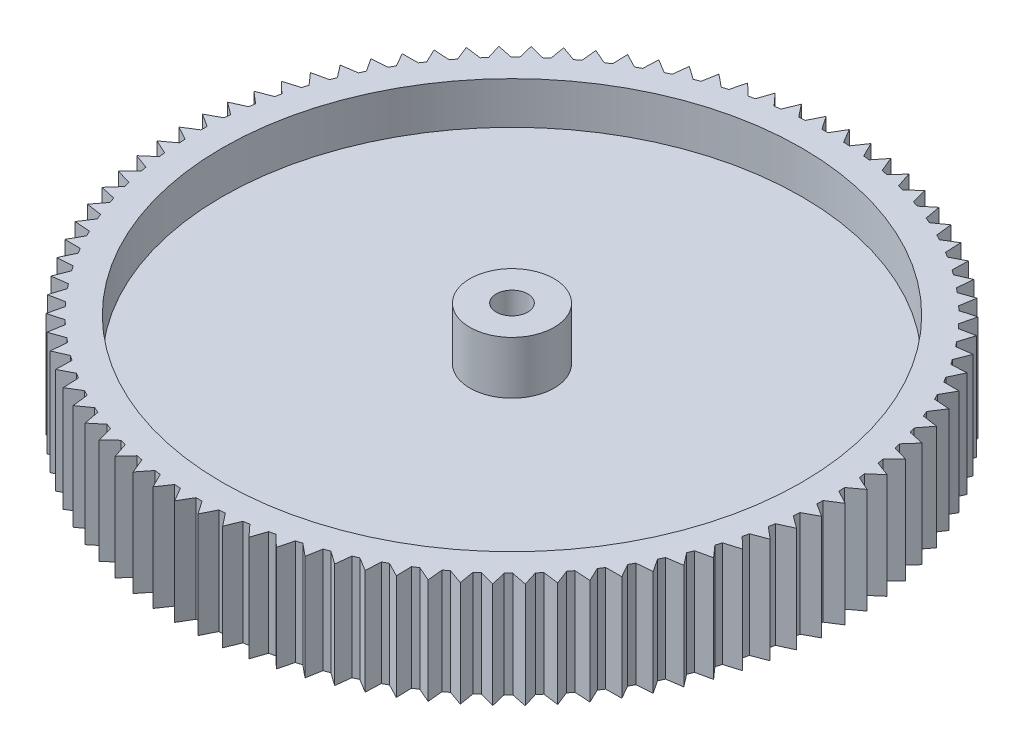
from build123d import *

# Parameters (mm, degrees)
BOSS_EXTRU_1_DEPTH            = 10
D_GAGEMENT_M481_D             = 55
D_GAGEMENT_M481_DEPTH         = 4
D_GAGEMENT_M482_D             = 55
D_GAGEMENT_M482_DEPTH         = 4
ESQUISSE6_W                   = 4
ESQUISSE6_H                   = 3
ESQUISSE7_W                   = 4
ESQUISSE7_H                   = 5
DIAM_TRE_DU_PER_AGE_3_0_3_1_D = 3


with BuildPart() as part:
    # Esquisse1 → Boss.-Extru.1 (new body)
    with BuildSketch(Plane(origin=(0, 10, 0), x_dir=(1, 0, 0), z_dir=(0, 1, 0))):
        with BuildLine():
            Line((1.519609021, 29.961488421), (0.746596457, 31.270360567))
            Line((0.746596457, 31.270360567), (0, 30))
            ThreePointArc((0, 30), (-0.287063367, 29.998626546), (-0.57410045, 29.994506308))
            Line((-0.57410045, 29.994506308), (-1.4365323, 31.246267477))
            Line((-1.4365323, 31.246267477), (-2.092694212, 29.926921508))
            ThreePointArc((-2.092694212, 29.926921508), (-2.3789625, 29.905526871), (-2.665012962, 29.881393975))
            Line((-2.665012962, 29.881393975), (-3.612662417, 31.069945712))
            Line((-3.612662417, 31.069945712), (-4.175193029, 29.708042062))
            ThreePointArc((-4.175193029, 29.708042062), (-4.459271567, 29.666730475), (-4.742941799, 29.622702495))
            Line((-4.742941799, 29.622702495), (-5.771192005, 30.742254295))
            Line((-5.771192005, 30.742254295), (-6.237350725, 29.344428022))
            ThreePointArc((-6.237350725, 29.344428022), (-6.517855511, 29.283400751), (-6.7977635, 29.219692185))
            Line((-6.7977635, 29.219692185), (-7.901604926, 30.264789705))
            Line((-7.901604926, 30.264789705), (-8.269120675, 28.837850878))
            ThreePointArc((-8.269120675, 28.837850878), (-8.544685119, 28.757405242), (-8.81946718, 28.674326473))
            Line((-8.81946718, 28.674326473), (-9.993522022, 29.639878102))
            Line((-9.993522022, 29.639878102), (-10.2606043, 28.190778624))
            ThreePointArc((-10.2606043, 28.190778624), (-10.529885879, 28.091306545), (-10.798203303, 27.989262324))
            Line((-10.798203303, 27.989262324), (-12.036751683, 28.870563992))
            Line((-12.036751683, 28.870563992), (-12.202099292, 27.406363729))
            ThreePointArc((-12.202099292, 27.406363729), (-12.463786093, 27.288349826), (-12.724331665, 27.167837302))
            Line((-12.724331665, 27.167837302), (-14.0213395, 27.960595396))
            Line((-14.0213395, 27.960595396), (-14.084146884, 26.488427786))
            ThreePointArc((-14.084146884, 26.488427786), (-14.336963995, 26.35244701), (-14.588468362, 26.214053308))
            Line((-14.588468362, 26.214053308), (-15.93761676, 26.91440559))
            Line((-15.93761676, 26.91440559), (-15.897577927, 25.441442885))
            ThreePointArc((-15.897577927, 25.441442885), (-16.140293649, 25.288157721), (-16.381531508, 25.132557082))
            Line((-16.381531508, 25.132557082), (-17.776247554, 25.737091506))
            Line((-17.776247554, 25.737091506), (-17.633557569, 24.270509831))
            ThreePointArc((-17.633557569, 24.270509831), (-17.864989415, 24.10066707), (-18.094785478, 23.928617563))
            Line((-18.094785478, 23.928617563), (-19.528274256, 24.434388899))
            Line((-19.528274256, 24.434388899), (-19.283628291, 22.981333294))
            ThreePointArc((-19.283628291, 22.981333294), (-19.502648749, 22.795760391), (-19.719883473, 22.608100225))
            Line((-19.719883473, 22.608100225), (-21.185161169, 23.012644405))
            Line((-21.185161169, 23.012644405), (-20.839751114, 21.58019401))
            ThreePointArc((-20.839751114, 21.58019401), (-21.045293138, 21.379795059), (-21.248908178, 21.177438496))
            Line((-21.248908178, 21.177438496), (-22.738836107, 21.478784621))
            Line((-22.738836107, 21.478784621), (-22.294344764, 20.073918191))
            ThreePointArc((-22.294344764, 20.073918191), (-22.485406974, 19.859669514), (-22.674410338, 19.643602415))
            Line((-22.674410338, 19.643602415), (-24.18172972, 19.840282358))
            Line((-24.18172972, 19.840282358), (-23.640322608, 18.46984426))
            ThreePointArc((-23.640322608, 18.46984426), (-23.815974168, 18.242789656), (-23.98944505, 18.014064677))
            Line((-23.98944505, 18.014064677), (-25.506812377, 18.105120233))
            Line((-25.506812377, 18.105120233), (-24.871127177, 16.775787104))
            ThreePointArc((-24.871127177, 16.775787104), (-25.030512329, 16.537032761), (-25.187605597, 16.296764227))
            Line((-25.187605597, 16.296764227), (-26.707628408, 16.281751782))
            Line((-26.707628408, 16.281751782), (-25.980762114, 15))
            ThreePointArc((-25.980762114, 15), (-26.123104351, 14.750709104), (-26.263054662, 14.50006758))
            Line((-26.263054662, 14.50006758), (-27.778327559, 14.379060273))
            Line((-27.778327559, 14.379060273), (-26.963821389, 13.151134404))
            ThreePointArc((-26.963821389, 13.151134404), (-27.088427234, 12.892521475), (-27.210552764, 12.632728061))
            Line((-27.210552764, 12.632728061), (-28.713693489, 12.406315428))
            Line((-28.713693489, 12.406315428), (-27.815515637, 11.238197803))
            ThreePointArc((-27.815515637, 11.238197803), (-27.921778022, 10.971522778), (-28.025483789, 10.703843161))
            Line((-28.025483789, 10.703843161), (-29.509169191, 10.373128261))
            Line((-29.509169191, 10.373128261), (-28.531695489, 9.270509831))
            ThreePointArc((-28.531695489, 9.270509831), (-28.619096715, 8.997071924), (-28.703877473, 8.722810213))
            Line((-28.703877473, 8.722810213), (-30.160879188, 8.289404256))
            Line((-30.160879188, 8.289404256), (-29.108871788, 7.257656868))
            ThreePointArc((-29.108871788, 7.257656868), (-29.176986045, 6.978788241), (-29.242428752, 6.69928061))
            Line((-29.242428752, 6.69928061), (-30.665648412, 6.165295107))
            Line((-30.665648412, 6.165295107), (-29.54423259, 5.20944533))
            ThreePointArc((-29.54423259, 5.20944533), (-29.592728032, 4.926504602), (-29.638513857, 4.643112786))
            Line((-29.638513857, 4.643112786), (-31.02101768, 4.011149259))
            Line((-31.02101768, 4.011149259), (-29.835656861, 3.135853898))
            ThreePointArc((-29.835656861, 3.135853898), (-29.864297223, 2.850219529), (-29.890203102, 2.564324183))
            Line((-29.890203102, 2.564324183), (-31.225255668, 1.837461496))
            Line((-31.225255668, 1.837461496), (-29.981724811, 1.046984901))
            ThreePointArc((-29.981724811, 1.046984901), (-29.99037056, 0.760048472), (-29.996270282, 0.47304245))
            Line((-29.996270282, 0.47304245), (-31.277367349, -0.345178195))
            Line((-31.277367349, -0.345178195), (-29.981724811, -1.046984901))
            ThreePointArc((-29.981724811, -1.046984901), (-29.970333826, -1.333825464), (-29.956198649, -1.620543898))
            Line((-29.956198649, -1.620543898), (-31.177098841, -2.526136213))
            Line((-31.177098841, -2.526136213), (-29.835656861, -3.135853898))
            ThreePointArc((-29.835656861, -3.135853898), (-29.804284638, -3.421201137), (-29.770183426, -3.706235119))
            Line((-29.770183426, -3.706235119), (-30.92493864, -4.694787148))
            Line((-30.92493864, -4.694787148), (-29.54423259, -5.20944533))
            ThreePointArc((-29.54423259, -5.20944533), (-29.493031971, -5.491909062), (-29.439130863, -5.773869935))
            Line((-29.439130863, -5.773869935), (-30.522115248, -6.840565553))
            Line((-30.522115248, -6.840565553), (-29.108871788, -7.257656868))
            ThreePointArc((-29.108871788, -7.257656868), (-29.038092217, -7.535860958), (-28.964653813, -7.813375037))
            Line((-28.964653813, -7.813375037), (-29.970591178, -8.95301741))
            Line((-29.970591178, -8.95301741), (-28.531695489, -9.270509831))
            ThreePointArc((-28.531695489, -9.270509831), (-28.441681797, -9.543098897), (-28.349063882, -9.814814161))
            Line((-28.349063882, -9.814814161), (-29.2730534, -11.021851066))
            Line((-29.2730534, -11.021851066), (-27.815515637, -11.238197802))
            ThreePointArc((-27.815515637, -11.238197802), (-27.706706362, -11.503843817), (-27.595360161, -11.768436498))
            Line((-27.595360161, -11.768436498), (-28.432900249, -13.036987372))
            Line((-28.432900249, -13.036987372), (-26.963821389, -13.151134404))
            ThreePointArc((-26.963821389, -13.151134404), (-26.836746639, -13.408543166), (-26.707214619, -13.664724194))
            Line((-26.707214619, -13.664724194), (-27.454224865, -14.988608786))
            Line((-27.454224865, -14.988608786), (-25.980762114, -15))
            ThreePointArc((-25.980762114, -15), (-25.836040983, -15.247917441), (-25.688954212, -15.494438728))
            Line((-25.688954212, -15.494438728), (-26.341795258, -16.867207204))
            Line((-26.341795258, -16.867207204), (-24.871127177, -16.775787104))
            ThreePointArc((-24.871127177, -16.775787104), (-24.709464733, -17.013005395), (-24.545539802, -17.248665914))
            Line((-24.545539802, -17.248665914), (-25.101031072, -18.663630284))
            Line((-25.101031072, -18.663630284), (-23.640322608, -18.46984426))
            ThreePointArc((-23.640322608, -18.46984426), (-23.462506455, -18.695207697), (-23.28254199, -18.918859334))
            Line((-23.28254199, -18.918859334), (-23.737977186, -20.369126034))
            Line((-23.737977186, -20.369126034), (-22.294344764, -20.073918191))
            ThreePointArc((-22.294344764, -20.073918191), (-22.101241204, -20.286328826), (-21.906113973, -20.496881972))
            Line((-21.906113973, -20.496881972), (-22.259274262, -21.975385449))
            Line((-22.259274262, -21.975385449), (-20.839751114, -21.58019401))
            ThreePointArc((-20.839751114, -21.58019401), (-20.632300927, -21.778617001), (-20.422961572, -21.975045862))
            Line((-20.422961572, -21.975045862), (-20.67212639, -23.474582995))
            Line((-20.67212639, -23.474582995), (-19.283628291, -22.981333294))
            ThreePointArc((-19.283628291, -22.981333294), (-19.062842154, -23.164801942), (-18.840310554, -23.346149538))
            Line((-18.840310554, -23.346149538), (-18.984265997, -24.859414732))
            Line((-18.984265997, -24.859414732), (-17.633557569, -24.270509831))
            ThreePointArc((-17.633557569, -24.270509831), (-17.40051113, -24.438130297), (-17.165871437, -24.603513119))
            Line((-17.165871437, -24.603513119), (-17.203916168, -26.1231339))
            Line((-17.203916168, -26.1231339), (-15.897577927, -25.441442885))
            ThreePointArc((-15.897577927, -25.441442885), (-15.653406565, -25.592398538), (-15.40780192, -25.741010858))
            Line((-15.40780192, -25.741010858), (-15.339750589, -27.259583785))
            Line((-15.339750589, -27.259583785), (-14.084146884, -26.488427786))
            ThreePointArc((-14.084146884, -26.488427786), (-13.830040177, -26.621983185), (-13.574667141, -26.753100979))
            Line((-13.574667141, -26.753100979), (-13.400851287, -28.263227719))
            Line((-13.400851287, -28.263227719), (-12.202099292, -27.406363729))
            ThreePointArc((-12.202099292, -27.406363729), (-11.939295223, -27.521868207), (-11.675397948, -27.634852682))
            Line((-11.675397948, -27.634852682), (-11.396664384, -29.129176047))
            Line((-11.396664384, -29.129176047), (-10.2606043, -28.190778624))
            ThreePointArc((-10.2606043, -28.190778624), (-9.990383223, -28.287669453), (-9.71924739, -28.38197016))
            Line((-9.71924739, -28.38197016), (-9.336954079, -29.853209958))
            Line((-9.336954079, -29.853209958), (-8.269120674, -28.837850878))
            ThreePointArc((-8.269120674, -28.837850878), (-7.99279908, -28.915656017), (-7.715745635, -28.990813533))
            Line((-7.715745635, -28.990813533), (-7.231755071, -30.431802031))
            Line((-7.231755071, -30.431802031), (-6.237350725, -29.344428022))
            ThreePointArc((-6.237350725, -29.344428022), (-5.956274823, -29.402768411), (-5.674653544, -29.458416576))
            Line((-5.674653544, -29.458416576), (-5.09132368, -30.862133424))
            Line((-5.09132368, -30.862133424), (-4.175193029, -29.708042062))
            ThreePointArc((-4.175193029, -29.708042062), (-3.890732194, -29.746633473), (-3.605915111, -29.782501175))
            Line((-3.605915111, -29.782501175), (-2.926087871, -31.142107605))
            Line((-2.926087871, -31.142107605), (-2.092694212, -29.926921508))
            ThreePointArc((-2.092694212, -29.926921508), (-1.80623431, -29.945575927), (-1.519609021, -29.961488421))
            Line((-1.519609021, -29.961488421), (-0.746596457, -31.270360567))
            Line((-0.746596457, -31.270360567), (0, -30))
            ThreePointArc((0, -30), (0.287063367, -29.998626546), (0.57410045, -29.994506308))
            Line((0.57410045, -29.994506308), (1.4365323, -31.246267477))
            Line((1.4365323, -31.246267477), (2.092694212, -29.926921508))
            ThreePointArc((2.092694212, -29.926921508), (2.3789625, -29.905526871), (2.665012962, -29.881393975))
            Line((2.665012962, -29.881393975), (3.612662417, -31.069945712))
            Line((3.612662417, -31.069945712), (4.175193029, -29.708042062))
            ThreePointArc((4.175193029, -29.708042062), (4.459271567, -29.666730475), (4.742941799, -29.622702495))
            Line((4.742941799, -29.622702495), (5.771192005, -30.742254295))
            Line((5.771192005, -30.742254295), (6.237350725, -29.344428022))
            ThreePointArc((6.237350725, -29.344428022), (6.517855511, -29.283400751), (6.7977635, -29.219692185))
            Line((6.7977635, -29.219692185), (7.901604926, -30.264789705))
            Line((7.901604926, -30.264789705), (8.269120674, -28.837850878))
            ThreePointArc((8.269120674, -28.837850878), (8.544685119, -28.757405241), (8.81946718, -28.674326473))
            Line((8.81946718, -28.674326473), (9.993522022, -29.639878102))
            Line((9.993522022, -29.639878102), (10.2606043, -28.190778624))
            ThreePointArc((10.2606043, -28.190778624), (10.529885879, -28.091306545), (10.798203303, -27.989262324))
            Line((10.798203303, -27.989262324), (12.036751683, -28.870563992))
            Line((12.036751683, -28.870563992), (12.202099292, -27.406363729))
            ThreePointArc((12.202099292, -27.406363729), (12.463786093, -27.288349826), (12.724331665, -27.167837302))
            Line((12.724331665, -27.167837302), (14.0213395, -27.960595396))
            Line((14.0213395, -27.960595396), (14.084146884, -26.488427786))
            ThreePointArc((14.084146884, -26.488427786), (14.336963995, -26.35244701), (14.588468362, -26.214053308))
            Line((14.588468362, -26.214053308), (15.93761676, -26.91440559))
            Line((15.93761676, -26.91440559), (15.897577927, -25.441442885))
            ThreePointArc((15.897577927, -25.441442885), (16.140293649, -25.288157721), (16.381531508, -25.132557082))
            Line((16.381531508, -25.132557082), (17.776247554, -25.737091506))
            Line((17.776247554, -25.737091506), (17.633557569, -24.270509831))
            ThreePointArc((17.633557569, -24.270509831), (17.864989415, -24.100667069), (18.094785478, -23.928617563))
            Line((18.094785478, -23.928617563), (19.528274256, -24.434388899))
            Line((19.528274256, -24.434388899), (19.283628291, -22.981333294))
            ThreePointArc((19.283628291, -22.981333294), (19.502648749, -22.795760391), (19.719883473, -22.608100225))
            Line((19.719883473, -22.608100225), (21.185161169, -23.012644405))
            Line((21.185161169, -23.012644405), (20.839751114, -21.58019401))
            ThreePointArc((20.839751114, -21.58019401), (21.045293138, -21.379795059), (21.248908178, -21.177438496))
            Line((21.248908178, -21.177438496), (22.738836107, -21.478784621))
            Line((22.738836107, -21.478784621), (22.294344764, -20.073918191))
            ThreePointArc((22.294344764, -20.073918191), (22.485406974, -19.859669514), (22.674410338, -19.643602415))
            Line((22.674410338, -19.643602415), (24.18172972, -19.840282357))
            Line((24.18172972, -19.840282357), (23.640322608, -18.46984426))
            ThreePointArc((23.640322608, -18.46984426), (23.815974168, -18.242789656), (23.98944505, -18.014064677))
            Line((23.98944505, -18.014064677), (25.506812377, -18.105120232))
            Line((25.506812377, -18.105120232), (24.871127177, -16.775787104))
            ThreePointArc((24.871127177, -16.775787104), (25.030512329, -16.537032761), (25.187605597, -16.296764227))
            Line((25.187605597, -16.296764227), (26.707628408, -16.281751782))
            Line((26.707628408, -16.281751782), (25.980762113, -15))
            ThreePointArc((25.980762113, -15), (26.123104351, -14.750709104), (26.263054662, -14.50006758))
            Line((26.263054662, -14.50006758), (27.778327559, -14.379060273))
            Line((27.778327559, -14.379060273), (26.963821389, -13.151134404))
            ThreePointArc((26.963821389, -13.151134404), (27.088427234, -12.892521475), (27.210552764, -12.632728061))
            Line((27.210552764, -12.632728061), (28.713693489, -12.406315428))
            Line((28.713693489, -12.406315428), (27.815515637, -11.238197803))
            ThreePointArc((27.815515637, -11.238197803), (27.921778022, -10.971522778), (28.025483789, -10.703843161))
            Line((28.025483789, -10.703843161), (29.509169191, -10.373128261))
            Line((29.509169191, -10.373128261), (28.531695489, -9.270509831))
            ThreePointArc((28.531695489, -9.270509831), (28.619096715, -8.997071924), (28.703877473, -8.722810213))
            Line((28.703877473, -8.722810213), (30.160879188, -8.289404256))
            Line((30.160879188, -8.289404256), (29.108871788, -7.257656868))
            ThreePointArc((29.108871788, -7.257656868), (29.176986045, -6.978788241), (29.242428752, -6.69928061))
            Line((29.242428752, -6.69928061), (30.665648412, -6.165295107))
            Line((30.665648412, -6.165295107), (29.54423259, -5.20944533))
            ThreePointArc((29.54423259, -5.20944533), (29.592728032, -4.926504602), (29.638513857, -4.643112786))
            Line((29.638513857, -4.643112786), (31.02101768, -4.011149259))
            Line((31.02101768, -4.011149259), (29.835656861, -3.135853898))
            ThreePointArc((29.835656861, -3.135853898), (29.864297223, -2.850219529), (29.890203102, -2.564324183))
            Line((29.890203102, -2.564324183), (31.225255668, -1.837461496))
            Line((31.225255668, -1.837461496), (29.981724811, -1.046984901))
            ThreePointArc((29.981724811, -1.046984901), (29.99037056, -0.760048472), (29.996270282, -0.47304245))
            Line((29.996270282, -0.47304245), (31.277367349, 0.345178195))
            Line((31.277367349, 0.345178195), (29.981724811, 1.046984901))
            ThreePointArc((29.981724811, 1.046984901), (29.970333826, 1.333825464), (29.956198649, 1.620543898))
            Line((29.956198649, 1.620543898), (31.177098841, 2.526136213))
            Line((31.177098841, 2.526136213), (29.835656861, 3.135853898))
            ThreePointArc((29.835656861, 3.135853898), (29.804284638, 3.421201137), (29.770183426, 3.706235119))
            Line((29.770183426, 3.706235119), (30.92493864, 4.694787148))
            Line((30.92493864, 4.694787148), (29.54423259, 5.20944533))
            ThreePointArc((29.54423259, 5.20944533), (29.493031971, 5.491909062), (29.439130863, 5.773869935))
            Line((29.439130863, 5.773869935), (30.522115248, 6.840565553))
            Line((30.522115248, 6.840565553), (29.108871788, 7.257656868))
            ThreePointArc((29.108871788, 7.257656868), (29.038092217, 7.535860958), (28.964653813, 7.813375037))
            Line((28.964653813, 7.813375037), (29.970591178, 8.95301741))
            Line((29.970591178, 8.95301741), (28.531695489, 9.270509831))
            ThreePointArc((28.531695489, 9.270509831), (28.441681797, 9.543098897), (28.349063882, 9.814814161))
            Line((28.349063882, 9.814814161), (29.2730534, 11.021851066))
            Line((29.2730534, 11.021851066), (27.815515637, 11.238197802))
            ThreePointArc((27.815515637, 11.238197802), (27.706706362, 11.503843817), (27.595360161, 11.768436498))
            Line((27.595360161, 11.768436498), (28.432900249, 13.036987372))
            Line((28.432900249, 13.036987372), (26.963821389, 13.151134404))
            ThreePointArc((26.963821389, 13.151134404), (26.836746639, 13.408543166), (26.707214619, 13.664724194))
            Line((26.707214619, 13.664724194), (27.454224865, 14.988608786))
            Line((27.454224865, 14.988608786), (25.980762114, 15))
            ThreePointArc((25.980762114, 15), (25.836040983, 15.247917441), (25.688954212, 15.494438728))
            Line((25.688954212, 15.494438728), (26.341795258, 16.867207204))
            Line((26.341795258, 16.867207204), (24.871127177, 16.775787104))
            ThreePointArc((24.871127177, 16.775787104), (24.709464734, 17.013005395), (24.545539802, 17.248665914))
            Line((24.545539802, 17.248665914), (25.101031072, 18.663630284))
            Line((25.101031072, 18.663630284), (23.640322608, 18.46984426))
            ThreePointArc((23.640322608, 18.46984426), (23.462506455, 18.695207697), (23.28254199, 18.918859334))
            Line((23.28254199, 18.918859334), (23.737977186, 20.369126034))
            Line((23.737977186, 20.369126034), (22.294344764, 20.073918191))
            ThreePointArc((22.294344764, 20.073918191), (22.101241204, 20.286328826), (21.906113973, 20.496881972))
            Line((21.906113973, 20.496881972), (22.259274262, 21.975385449))
            Line((22.259274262, 21.975385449), (20.839751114, 21.58019401))
            ThreePointArc((20.839751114, 21.58019401), (20.632300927, 21.778617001), (20.422961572, 21.975045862))
            Line((20.422961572, 21.975045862), (20.67212639, 23.474582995))
            Line((20.67212639, 23.474582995), (19.283628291, 22.981333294))
            ThreePointArc((19.283628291, 22.981333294), (19.062842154, 23.164801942), (18.840310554, 23.346149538))
            Line((18.840310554, 23.346149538), (18.984265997, 24.859414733))
            Line((18.984265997, 24.859414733), (17.633557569, 24.270509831))
            ThreePointArc((17.633557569, 24.270509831), (17.40051113, 24.438130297), (17.165871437, 24.603513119))
            Line((17.165871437, 24.603513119), (17.203916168, 26.1231339))
            Line((17.203916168, 26.1231339), (15.897577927, 25.441442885))
            ThreePointArc((15.897577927, 25.441442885), (15.653406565, 25.592398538), (15.40780192, 25.741010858))
            Line((15.40780192, 25.741010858), (15.339750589, 27.259583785))
            Line((15.339750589, 27.259583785), (14.084146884, 26.488427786))
            ThreePointArc((14.084146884, 26.488427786), (13.830040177, 26.621983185), (13.574667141, 26.753100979))
            Line((13.574667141, 26.753100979), (13.400851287, 28.263227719))
            Line((13.400851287, 28.263227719), (12.202099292, 27.406363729))
            ThreePointArc((12.202099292, 27.406363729), (11.939295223, 27.521868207), (11.675397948, 27.634852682))
            Line((11.675397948, 27.634852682), (11.396664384, 29.129176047))
            Line((11.396664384, 29.129176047), (10.2606043, 28.190778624))
            ThreePointArc((10.2606043, 28.190778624), (9.990383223, 28.287669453), (9.71924739, 28.38197016))
            Line((9.71924739, 28.38197016), (9.336954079, 29.853209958))
            Line((9.336954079, 29.853209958), (8.269120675, 28.837850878))
            ThreePointArc((8.269120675, 28.837850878), (7.99279908, 28.915656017), (7.715745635, 28.990813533))
            Line((7.715745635, 28.990813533), (7.231755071, 30.431802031))
            Line((7.231755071, 30.431802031), (6.237350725, 29.344428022))
            ThreePointArc((6.237350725, 29.344428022), (5.956274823, 29.402768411), (5.674653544, 29.458416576))
            Line((5.674653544, 29.458416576), (5.09132368, 30.862133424))
            Line((5.09132368, 30.862133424), (4.175193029, 29.708042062))
            ThreePointArc((4.175193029, 29.708042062), (3.890732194, 29.746633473), (3.605915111, 29.782501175))
            Line((3.605915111, 29.782501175), (2.926087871, 31.142107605))
            Line((2.926087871, 31.142107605), (2.092694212, 29.926921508))
            ThreePointArc((2.092694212, 29.926921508), (1.80623431, 29.945575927), (1.519609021, 29.961488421))
        make_face()
    extrude(amount=-BOSS_EXTRU_1_DEPTH)

    # D_gagement M481
    with Locations(Plane(origin=(0, 10, 0), x_dir=(1, 0, 0), z_dir=(0, 1, 0))):
        with Locations((0, 0)):
            Hole(D_GAGEMENT_M481_D / 2, depth=D_GAGEMENT_M481_DEPTH)

    # D_gagement M482
    with Locations(Plane(origin=(0, 0, 0), x_dir=(-1, 0, 0), z_dir=(0, -1, 0))):
        with Locations((0, 0)):
            Hole(D_GAGEMENT_M482_D / 2, depth=D_GAGEMENT_M482_DEPTH)

    # Esquisse6 → R_volution1 (revolve)
    with BuildSketch(Plane.XY, mode=Mode.PRIVATE) as r_volution1_sk:
        with Locations((2, 2.5)):
            Rectangle(ESQUISSE6_W, ESQUISSE6_H)
    revolve(r_volution1_sk.sketch.rotate(Axis((0, 4, 0), (0, -1, 0)), 270), axis=Axis((0, 4, 0), (0, -1, 0)))

    # Esquisse7 → R_volution2 (revolve)
    with BuildSketch(Plane.XY, mode=Mode.PRIVATE) as r_volution2_sk:
        with Locations((2, 8.5)):
            Rectangle(ESQUISSE7_W, ESQUISSE7_H)
    revolve(r_volution2_sk.sketch.rotate(Axis((0, 11, 0), (0, -1, 0)), 270), axis=Axis((0, 11, 0), (0, -1, 0)))

    # Diam_tre du per_age _3.0 _3_1 (through all)
    with Locations(Plane(origin=(0, 1, 0), x_dir=(-1, 0, 0), z_dir=(0, -1, 0))):
        with Locations((0, 0)):
            Hole(DIAM_TRE_DU_PER_AGE_3_0_3_1_D / 2)


solid = part.part
